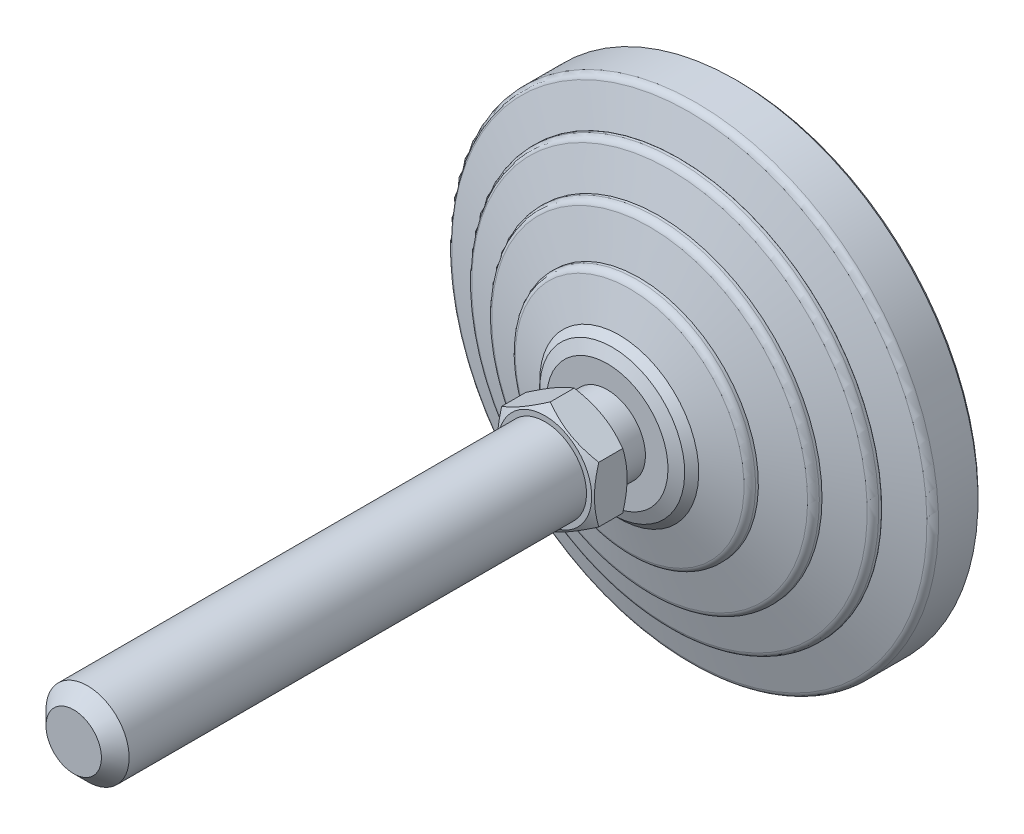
ISO-10303-21;
HEADER;
FILE_DESCRIPTION(('STEP AP214'),'2;1');
FILE_NAME('part.step','',(''),(''),'','','');
FILE_SCHEMA(('AUTOMOTIVE_DESIGN { 1 0 10303 214 1 1 1 1 }'));
ENDSEC;
DATA;
#1=APPLICATION_CONTEXT('core data for automotive mechanical design processes');
#2=APPLICATION_PROTOCOL_DEFINITION('international standard','automotive_design',2000,#1);
#3=PRODUCT_CONTEXT('',#1,'mechanical');
#4=PRODUCT('Part','Part','',(#3));
#5=PRODUCT_RELATED_PRODUCT_CATEGORY('part','',(#4));
#6=PRODUCT_DEFINITION_FORMATION('','',#4);
#7=PRODUCT_DEFINITION_CONTEXT('part definition',#1,'design');
#8=PRODUCT_DEFINITION('design','',#6,#7);
#9=PRODUCT_DEFINITION_SHAPE('','',#8);
#10=(LENGTH_UNIT() NAMED_UNIT(*) SI_UNIT(.MILLI.,.METRE.));
#11=(NAMED_UNIT(*) PLANE_ANGLE_UNIT() SI_UNIT($,.RADIAN.));
#12=(NAMED_UNIT(*) SI_UNIT($,.STERADIAN.) SOLID_ANGLE_UNIT());
#13=UNCERTAINTY_MEASURE_WITH_UNIT(LENGTH_MEASURE(1.E-05),#10,'distance_accuracy_value','');
#14=(GEOMETRIC_REPRESENTATION_CONTEXT(3) GLOBAL_UNCERTAINTY_ASSIGNED_CONTEXT((#13)) GLOBAL_UNIT_ASSIGNED_CONTEXT((#10,
#11,#12)) REPRESENTATION_CONTEXT('',''));
#15=CARTESIAN_POINT('',(0.,0.,0.));
#16=DIRECTION('',(0.,0.,1.));
#17=DIRECTION('',(1.,0.,0.));
#18=AXIS2_PLACEMENT_3D('',#15,#16,#17);
#19=CARTESIAN_POINT('',(-5.5,0.,23.));
#20=DIRECTION('',(0.,0.,1.));
#21=DIRECTION('',(0.,-1.,0.));
#22=AXIS2_PLACEMENT_3D('',#19,#20,#21);
#23=PLANE('',#22);
#24=CARTESIAN_POINT('',(0.,0.,23.));
#25=DIRECTION('',(0.,0.,-1.));
#26=DIRECTION('',(-1.,0.,0.));
#27=AXIS2_PLACEMENT_3D('',#24,#25,#26);
#28=CIRCLE('',#27,6.75);
#29=CARTESIAN_POINT('',(-6.75,0.,23.));
#30=VERTEX_POINT('',#29);
#31=EDGE_CURVE('E605',#30,#30,#28,.T.);
#32=ORIENTED_EDGE('',*,*,#31,.T.);
#33=EDGE_LOOP('',(#32));
#34=FACE_BOUND('',#33,.T.);
#35=CARTESIAN_POINT('',(0.,0.,23.));
#36=DIRECTION('',(0.,0.,-1.));
#37=DIRECTION('',(0.,1.,0.));
#38=AXIS2_PLACEMENT_3D('',#35,#36,#37);
#39=CIRCLE('',#38,5.5);
#40=CARTESIAN_POINT('',(0.,5.5,23.));
#41=VERTEX_POINT('',#40);
#42=EDGE_CURVE('E153',#41,#41,#39,.T.);
#43=ORIENTED_EDGE('',*,*,#42,.F.);
#44=EDGE_LOOP('',(#43));
#45=FACE_BOUND('',#44,.T.);
#46=ADVANCED_FACE('F14',(#34,#45),#23,.F.);
#47=CARTESIAN_POINT('',(0.,0.,0.));
#48=DIRECTION('',(0.,0.,-1.));
#49=DIRECTION('',(0.,1.,0.));
#50=AXIS2_PLACEMENT_3D('',#47,#48,#49);
#51=CYLINDRICAL_SURFACE('',#50,5.5);
#52=CARTESIAN_POINT('',(0.,0.,19.));
#53=DIRECTION('',(0.,0.,-1.));
#54=DIRECTION('',(0.,1.,0.));
#55=AXIS2_PLACEMENT_3D('',#52,#53,#54);
#56=CIRCLE('',#55,5.5);
#57=CARTESIAN_POINT('',(0.,5.5,19.));
#58=VERTEX_POINT('',#57);
#59=EDGE_CURVE('E150',#58,#58,#56,.T.);
#60=ORIENTED_EDGE('',*,*,#59,.F.);
#61=EDGE_LOOP('',(#60));
#62=FACE_BOUND('',#61,.T.);
#63=ORIENTED_EDGE('',*,*,#42,.T.);
#64=EDGE_LOOP('',(#63));
#65=FACE_BOUND('',#64,.T.);
#66=ADVANCED_FACE('F179',(#62,#65),#51,.T.);
#67=CARTESIAN_POINT('',(-8.7540983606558,0.,19.));
#68=DIRECTION('',(0.,0.,-1.));
#69=DIRECTION('',(0.,1.,0.));
#70=AXIS2_PLACEMENT_3D('',#67,#68,#69);
#71=PLANE('',#70);
#72=CARTESIAN_POINT('',(0.,0.,19.));
#73=DIRECTION('',(0.,0.,-1.));
#74=DIRECTION('',(0.,1.,0.));
#75=AXIS2_PLACEMENT_3D('',#72,#73,#74);
#76=CIRCLE('',#75,8.7540983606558);
#77=CARTESIAN_POINT('',(0.,8.7540983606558,19.));
#78=VERTEX_POINT('',#77);
#79=EDGE_CURVE('E147',#78,#78,#76,.T.);
#80=ORIENTED_EDGE('',*,*,#79,.F.);
#81=EDGE_LOOP('',(#80));
#82=FACE_BOUND('',#81,.T.);
#83=ORIENTED_EDGE('',*,*,#59,.T.);
#84=EDGE_LOOP('',(#83));
#85=FACE_BOUND('',#84,.T.);
#86=ADVANCED_FACE('F186',(#82,#85),#71,.F.);
#87=CARTESIAN_POINT('',(0.,0.,19.));
#88=DIRECTION('',(0.,0.,-1.));
#89=DIRECTION('',(0.,1.,0.));
#90=AXIS2_PLACEMENT_3D('',#87,#88,#89);
#91=CONICAL_SURFACE('',#90,8.7540983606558,1.17809724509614);
#92=CARTESIAN_POINT('',(0.,0.,18.2928932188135));
#93=DIRECTION('',(0.,0.,-1.));
#94=DIRECTION('',(0.,1.,0.));
#95=AXIS2_PLACEMENT_3D('',#92,#93,#94);
#96=CIRCLE('',#95,10.4612051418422);
#97=CARTESIAN_POINT('',(0.,10.4612051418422,18.2928932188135));
#98=VERTEX_POINT('',#97);
#99=EDGE_CURVE('E144',#98,#98,#96,.T.);
#100=ORIENTED_EDGE('',*,*,#99,.F.);
#101=EDGE_LOOP('',(#100));
#102=FACE_BOUND('',#101,.T.);
#103=ORIENTED_EDGE('',*,*,#79,.T.);
#104=EDGE_LOOP('',(#103));
#105=FACE_BOUND('',#104,.T.);
#106=ADVANCED_FACE('F433',(#102,#105),#91,.T.);
#107=CARTESIAN_POINT('',(0.,0.,18.2928932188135));
#108=DIRECTION('',(0.,0.,-1.));
#109=DIRECTION('',(0.,1.,0.));
#110=AXIS2_PLACEMENT_3D('',#107,#108,#109);
#111=CONICAL_SURFACE('',#110,10.4612051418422,0.785398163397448);
#112=CARTESIAN_POINT('',(0.,0.,17.2786885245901));
#113=DIRECTION('',(0.,0.,-1.));
#114=DIRECTION('',(0.,1.,0.));
#115=AXIS2_PLACEMENT_3D('',#112,#113,#114);
#116=CIRCLE('',#115,11.4754098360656);
#117=CARTESIAN_POINT('',(0.,11.4754098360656,17.2786885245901));
#118=VERTEX_POINT('',#117);
#119=EDGE_CURVE('E141',#118,#118,#116,.T.);
#120=ORIENTED_EDGE('',*,*,#119,.F.);
#121=EDGE_LOOP('',(#120));
#122=FACE_BOUND('',#121,.T.);
#123=ORIENTED_EDGE('',*,*,#99,.T.);
#124=EDGE_LOOP('',(#123));
#125=FACE_BOUND('',#124,.T.);
#126=ADVANCED_FACE('F423',(#122,#125),#111,.T.);
#127=CARTESIAN_POINT('',(0.,0.,17.2786885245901));
#128=DIRECTION('',(0.,0.,-1.));
#129=DIRECTION('',(0.,1.,0.));
#130=AXIS2_PLACEMENT_3D('',#127,#128,#129);
#131=CONICAL_SURFACE('',#130,11.4754098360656,1.27933953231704);
#132=CARTESIAN_POINT('',(0.,0.,15.7711726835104));
#133=DIRECTION('',(0.,0.,-1.));
#134=DIRECTION('',(0.,1.,0.));
#135=AXIS2_PLACEMENT_3D('',#132,#133,#134);
#136=CIRCLE('',#135,16.5004626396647);
#137=CARTESIAN_POINT('',(0.,16.5004626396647,15.7711726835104));
#138=VERTEX_POINT('',#137);
#139=EDGE_CURVE('E138',#138,#138,#136,.T.);
#140=ORIENTED_EDGE('',*,*,#139,.F.);
#141=EDGE_LOOP('',(#140));
#142=FACE_BOUND('',#141,.T.);
#143=ORIENTED_EDGE('',*,*,#119,.T.);
#144=EDGE_LOOP('',(#143));
#145=FACE_BOUND('',#144,.T.);
#146=ADVANCED_FACE('F413',(#142,#145),#131,.T.);
#147=CARTESIAN_POINT('',(0.,0.,14.8133463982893));
#148=DIRECTION('',(0.,0.,-1.));
#149=DIRECTION('',(0.,1.,0.));
#150=AXIS2_PLACEMENT_3D('',#147,#148,#149);
#151=TOROIDAL_SURFACE('',#150,16.2131147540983,1.);
#152=CARTESIAN_POINT('',(0.,0.,14.8133463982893));
#153=DIRECTION('',(0.,0.,-1.));
#154=DIRECTION('',(0.,1.,0.));
#155=AXIS2_PLACEMENT_3D('',#152,#153,#154);
#156=CIRCLE('',#155,17.2131147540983);
#157=CARTESIAN_POINT('',(0.,17.2131147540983,14.8133463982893));
#158=VERTEX_POINT('',#157);
#159=EDGE_CURVE('E135',#158,#158,#156,.T.);
#160=ORIENTED_EDGE('',*,*,#159,.F.);
#161=EDGE_LOOP('',(#160));
#162=FACE_BOUND('',#161,.T.);
#163=ORIENTED_EDGE('',*,*,#139,.T.);
#164=EDGE_LOOP('',(#163));
#165=FACE_BOUND('',#164,.T.);
#166=ADVANCED_FACE('F403',(#162,#165),#151,.T.);
#167=CARTESIAN_POINT('',(0.,0.,0.));
#168=DIRECTION('',(0.,0.,-1.));
#169=DIRECTION('',(0.,1.,0.));
#170=AXIS2_PLACEMENT_3D('',#167,#168,#169);
#171=CYLINDRICAL_SURFACE('',#170,17.2131147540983);
#172=CARTESIAN_POINT('',(0.,0.,14.4098360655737));
#173=DIRECTION('',(0.,0.,-1.));
#174=DIRECTION('',(0.,1.,0.));
#175=AXIS2_PLACEMENT_3D('',#172,#173,#174);
#176=CIRCLE('',#175,17.2131147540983);
#177=CARTESIAN_POINT('',(0.,17.2131147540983,14.4098360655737));
#178=VERTEX_POINT('',#177);
#179=EDGE_CURVE('E132',#178,#178,#176,.T.);
#180=ORIENTED_EDGE('',*,*,#179,.F.);
#181=EDGE_LOOP('',(#180));
#182=FACE_BOUND('',#181,.T.);
#183=ORIENTED_EDGE('',*,*,#159,.T.);
#184=EDGE_LOOP('',(#183));
#185=FACE_BOUND('',#184,.T.);
#186=ADVANCED_FACE('F393',(#182,#185),#171,.T.);
#187=CARTESIAN_POINT('',(0.,0.,14.4098360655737));
#188=DIRECTION('',(0.,0.,-1.));
#189=DIRECTION('',(0.,1.,0.));
#190=AXIS2_PLACEMENT_3D('',#187,#188,#189);
#191=CONICAL_SURFACE('',#190,17.2131147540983,1.30454427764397);
#192=CARTESIAN_POINT('',(0.,0.,12.8894925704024));
#193=DIRECTION('',(0.,0.,-1.));
#194=DIRECTION('',(0.,1.,0.));
#195=AXIS2_PLACEMENT_3D('',#192,#193,#194);
#196=CIRCLE('',#195,22.7877075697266);
#197=CARTESIAN_POINT('',(0.,22.7877075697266,12.8894925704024));
#198=VERTEX_POINT('',#197);
#199=EDGE_CURVE('E129',#198,#198,#196,.T.);
#200=ORIENTED_EDGE('',*,*,#199,.F.);
#201=EDGE_LOOP('',(#200));
#202=FACE_BOUND('',#201,.T.);
#203=ORIENTED_EDGE('',*,*,#179,.T.);
#204=EDGE_LOOP('',(#203));
#205=FACE_BOUND('',#204,.T.);
#206=ADVANCED_FACE('F383',(#202,#205),#191,.T.);
#207=CARTESIAN_POINT('',(0.,0.,11.9247287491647));
#208=DIRECTION('',(0.,0.,-1.));
#209=DIRECTION('',(0.,1.,0.));
#210=AXIS2_PLACEMENT_3D('',#207,#208,#209);
#211=TOROIDAL_SURFACE('',#210,22.5245901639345,1.);
#212=CARTESIAN_POINT('',(0.,0.,11.9247287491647));
#213=DIRECTION('',(0.,0.,-1.));
#214=DIRECTION('',(0.,1.,0.));
#215=AXIS2_PLACEMENT_3D('',#212,#213,#214);
#216=CIRCLE('',#215,23.5245901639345);
#217=CARTESIAN_POINT('',(0.,23.5245901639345,11.9247287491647));
#218=VERTEX_POINT('',#217);
#219=EDGE_CURVE('E126',#218,#218,#216,.T.);
#220=ORIENTED_EDGE('',*,*,#219,.F.);
#221=EDGE_LOOP('',(#220));
#222=FACE_BOUND('',#221,.T.);
#223=ORIENTED_EDGE('',*,*,#199,.T.);
#224=EDGE_LOOP('',(#223));
#225=FACE_BOUND('',#224,.T.);
#226=ADVANCED_FACE('F373',(#222,#225),#211,.T.);
#227=CARTESIAN_POINT('',(0.,0.,0.));
#228=DIRECTION('',(0.,0.,-1.));
#229=DIRECTION('',(0.,1.,0.));
#230=AXIS2_PLACEMENT_3D('',#227,#228,#229);
#231=CYLINDRICAL_SURFACE('',#230,23.5245901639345);
#232=CARTESIAN_POINT('',(0.,0.,11.5409836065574));
#233=DIRECTION('',(0.,0.,-1.));
#234=DIRECTION('',(0.,1.,0.));
#235=AXIS2_PLACEMENT_3D('',#232,#233,#234);
#236=CIRCLE('',#235,23.5245901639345);
#237=CARTESIAN_POINT('',(0.,23.5245901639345,11.5409836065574));
#238=VERTEX_POINT('',#237);
#239=EDGE_CURVE('E123',#238,#238,#236,.T.);
#240=ORIENTED_EDGE('',*,*,#239,.F.);
#241=EDGE_LOOP('',(#240));
#242=FACE_BOUND('',#241,.T.);
#243=ORIENTED_EDGE('',*,*,#219,.T.);
#244=EDGE_LOOP('',(#243));
#245=FACE_BOUND('',#244,.T.);
#246=ADVANCED_FACE('F363',(#242,#245),#231,.T.);
#247=CARTESIAN_POINT('',(0.,0.,11.5409836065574));
#248=DIRECTION('',(0.,0.,-1.));
#249=DIRECTION('',(0.,1.,0.));
#250=AXIS2_PLACEMENT_3D('',#247,#248,#249);
#251=CONICAL_SURFACE('',#250,23.5245901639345,1.27871257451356);
#252=CARTESIAN_POINT('',(0.,0.,10.0337743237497));
#253=DIRECTION('',(0.,0.,-1.));
#254=DIRECTION('',(0.,1.,0.));
#255=AXIS2_PLACEMENT_3D('',#252,#253,#254);
#256=CIRCLE('',#255,28.5372004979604);
#257=CARTESIAN_POINT('',(0.,28.5372004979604,10.0337743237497));
#258=VERTEX_POINT('',#257);
#259=EDGE_CURVE('E120',#258,#258,#256,.T.);
#260=ORIENTED_EDGE('',*,*,#259,.F.);
#261=EDGE_LOOP('',(#260));
#262=FACE_BOUND('',#261,.T.);
#263=ORIENTED_EDGE('',*,*,#239,.T.);
#264=EDGE_LOOP('',(#263));
#265=FACE_BOUND('',#264,.T.);
#266=ADVANCED_FACE('F353',(#262,#265),#251,.T.);
#267=CARTESIAN_POINT('',(0.,0.,9.07612838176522));
#268=DIRECTION('',(0.,0.,-1.));
#269=DIRECTION('',(0.,1.,0.));
#270=AXIS2_PLACEMENT_3D('',#267,#268,#269);
#271=TOROIDAL_SURFACE('',#270,28.2492521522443,0.999999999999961);
#272=CARTESIAN_POINT('',(0.,0.,9.07612838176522));
#273=DIRECTION('',(0.,0.,-1.));
#274=DIRECTION('',(0.,1.,0.));
#275=AXIS2_PLACEMENT_3D('',#272,#273,#274);
#276=CIRCLE('',#275,29.2492521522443);
#277=CARTESIAN_POINT('',(0.,29.2492521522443,9.07612838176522));
#278=VERTEX_POINT('',#277);
#279=EDGE_CURVE('E117',#278,#278,#276,.T.);
#280=ORIENTED_EDGE('',*,*,#279,.F.);
#281=EDGE_LOOP('',(#280));
#282=FACE_BOUND('',#281,.T.);
#283=ORIENTED_EDGE('',*,*,#259,.T.);
#284=EDGE_LOOP('',(#283));
#285=FACE_BOUND('',#284,.T.);
#286=ADVANCED_FACE('F343',(#282,#285),#271,.T.);
#287=CARTESIAN_POINT('',(0.,0.,0.));
#288=DIRECTION('',(0.,0.,-1.));
#289=DIRECTION('',(0.,1.,0.));
#290=AXIS2_PLACEMENT_3D('',#287,#288,#289);
#291=CYLINDRICAL_SURFACE('',#290,29.2492521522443);
#292=CARTESIAN_POINT('',(0.,0.,8.67213114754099));
#293=DIRECTION('',(0.,0.,-1.));
#294=DIRECTION('',(0.,1.,0.));
#295=AXIS2_PLACEMENT_3D('',#292,#293,#294);
#296=CIRCLE('',#295,29.2492521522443);
#297=CARTESIAN_POINT('',(0.,29.2492521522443,8.67213114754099));
#298=VERTEX_POINT('',#297);
#299=EDGE_CURVE('E114',#298,#298,#296,.T.);
#300=ORIENTED_EDGE('',*,*,#299,.F.);
#301=EDGE_LOOP('',(#300));
#302=FACE_BOUND('',#301,.T.);
#303=ORIENTED_EDGE('',*,*,#279,.T.);
#304=EDGE_LOOP('',(#303));
#305=FACE_BOUND('',#304,.T.);
#306=ADVANCED_FACE('F333',(#302,#305),#291,.T.);
#307=CARTESIAN_POINT('',(-29.2622950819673,0.,8.67213114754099));
#308=DIRECTION('',(0.,0.,-1.));
#309=DIRECTION('',(0.,1.,0.));
#310=AXIS2_PLACEMENT_3D('',#307,#308,#309);
#311=PLANE('',#310);
#312=CARTESIAN_POINT('',(0.,0.,8.67213114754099));
#313=DIRECTION('',(0.,0.,-1.));
#314=DIRECTION('',(0.,1.,0.));
#315=AXIS2_PLACEMENT_3D('',#312,#313,#314);
#316=CIRCLE('',#315,29.2622950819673);
#317=CARTESIAN_POINT('',(0.,29.2622950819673,8.67213114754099));
#318=VERTEX_POINT('',#317);
#319=EDGE_CURVE('E111',#318,#318,#316,.T.);
#320=ORIENTED_EDGE('',*,*,#319,.F.);
#321=EDGE_LOOP('',(#320));
#322=FACE_BOUND('',#321,.T.);
#323=ORIENTED_EDGE('',*,*,#299,.T.);
#324=EDGE_LOOP('',(#323));
#325=FACE_BOUND('',#324,.T.);
#326=ADVANCED_FACE('F323',(#322,#325),#311,.F.);
#327=CARTESIAN_POINT('',(0.,0.,8.67213114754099));
#328=DIRECTION('',(0.,0.,-1.));
#329=DIRECTION('',(0.,1.,0.));
#330=AXIS2_PLACEMENT_3D('',#327,#328,#329);
#331=CONICAL_SURFACE('',#330,29.2622950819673,1.27933953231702);
#332=CARTESIAN_POINT('',(0.,0.,7.1646153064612));
#333=DIRECTION('',(0.,0.,-1.));
#334=DIRECTION('',(0.,1.,0.));
#335=AXIS2_PLACEMENT_3D('',#332,#333,#334);
#336=CIRCLE('',#335,34.2873478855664);
#337=CARTESIAN_POINT('',(0.,34.2873478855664,7.1646153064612));
#338=VERTEX_POINT('',#337);
#339=EDGE_CURVE('E108',#338,#338,#336,.T.);
#340=ORIENTED_EDGE('',*,*,#339,.F.);
#341=EDGE_LOOP('',(#340));
#342=FACE_BOUND('',#341,.T.);
#343=ORIENTED_EDGE('',*,*,#319,.T.);
#344=EDGE_LOOP('',(#343));
#345=FACE_BOUND('',#344,.T.);
#346=ADVANCED_FACE('F313',(#342,#345),#331,.T.);
#347=CARTESIAN_POINT('',(0.,0.,6.20678902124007));
#348=DIRECTION('',(0.,0.,-1.));
#349=DIRECTION('',(0.,1.,0.));
#350=AXIS2_PLACEMENT_3D('',#347,#348,#349);
#351=TOROIDAL_SURFACE('',#350,34.,1.);
#352=CARTESIAN_POINT('',(0.,0.,6.20678902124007));
#353=DIRECTION('',(0.,0.,-1.));
#354=DIRECTION('',(0.,1.,0.));
#355=AXIS2_PLACEMENT_3D('',#352,#353,#354);
#356=CIRCLE('',#355,35.);
#357=CARTESIAN_POINT('',(0.,35.,6.20678902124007));
#358=VERTEX_POINT('',#357);
#359=EDGE_CURVE('E105',#358,#358,#356,.T.);
#360=ORIENTED_EDGE('',*,*,#359,.F.);
#361=EDGE_LOOP('',(#360));
#362=FACE_BOUND('',#361,.T.);
#363=ORIENTED_EDGE('',*,*,#339,.T.);
#364=EDGE_LOOP('',(#363));
#365=FACE_BOUND('',#364,.T.);
#366=ADVANCED_FACE('F303',(#362,#365),#351,.T.);
#367=CARTESIAN_POINT('',(0.,0.,0.));
#368=DIRECTION('',(0.,0.,-1.));
#369=DIRECTION('',(0.,1.,0.));
#370=AXIS2_PLACEMENT_3D('',#367,#368,#369);
#371=CYLINDRICAL_SURFACE('',#370,35.);
#372=CARTESIAN_POINT('',(0.,0.,0.5));
#373=DIRECTION('',(0.,0.,-1.));
#374=DIRECTION('',(0.,1.,0.));
#375=AXIS2_PLACEMENT_3D('',#372,#373,#374);
#376=CIRCLE('',#375,35.);
#377=CARTESIAN_POINT('',(0.,35.,0.5));
#378=VERTEX_POINT('',#377);
#379=EDGE_CURVE('E102',#378,#378,#376,.T.);
#380=ORIENTED_EDGE('',*,*,#379,.F.);
#381=EDGE_LOOP('',(#380));
#382=FACE_BOUND('',#381,.T.);
#383=ORIENTED_EDGE('',*,*,#359,.T.);
#384=EDGE_LOOP('',(#383));
#385=FACE_BOUND('',#384,.T.);
#386=ADVANCED_FACE('F293',(#382,#385),#371,.T.);
#387=CARTESIAN_POINT('',(0.,0.,0.5));
#388=DIRECTION('',(0.,0.,1.));
#389=DIRECTION('',(0.,-1.,0.));
#390=AXIS2_PLACEMENT_3D('',#387,#388,#389);
#391=CONICAL_SURFACE('',#390,35.,0.785398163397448);
#392=CARTESIAN_POINT('',(0.,0.,0.));
#393=DIRECTION('',(0.,0.,-1.));
#394=DIRECTION('',(0.,1.,0.));
#395=AXIS2_PLACEMENT_3D('',#392,#393,#394);
#396=CIRCLE('',#395,34.5);
#397=CARTESIAN_POINT('',(0.,34.5,0.));
#398=VERTEX_POINT('',#397);
#399=EDGE_CURVE('E99',#398,#398,#396,.T.);
#400=ORIENTED_EDGE('',*,*,#399,.F.);
#401=EDGE_LOOP('',(#400));
#402=FACE_BOUND('',#401,.T.);
#403=ORIENTED_EDGE('',*,*,#379,.T.);
#404=EDGE_LOOP('',(#403));
#405=FACE_BOUND('',#404,.T.);
#406=ADVANCED_FACE('F283',(#402,#405),#391,.T.);
#407=CARTESIAN_POINT('',(-34.5,0.,0.));
#408=DIRECTION('',(0.,0.,1.));
#409=DIRECTION('',(0.,-1.,0.));
#410=AXIS2_PLACEMENT_3D('',#407,#408,#409);
#411=PLANE('',#410);
#412=ORIENTED_EDGE('',*,*,#399,.T.);
#413=EDGE_LOOP('',(#412));
#414=FACE_BOUND('',#413,.T.);
#415=ADVANCED_FACE('F175',(#414),#411,.F.);
#416=CARTESIAN_POINT('',(0.,0.,24.9026537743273));
#417=DIRECTION('',(0.,0.,1.));
#418=DIRECTION('',(1.,0.,0.));
#419=AXIS2_PLACEMENT_3D('',#416,#417,#418);
#420=CONICAL_SURFACE('',#419,10.0454930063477,1.0471975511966);
#421=CARTESIAN_POINT('',(0.000200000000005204,-8.08301923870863,23.7696190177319));
#422=CARTESIAN_POINT('',(-0.153667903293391,-7.99418356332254,23.7183374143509));
#423=CARTESIAN_POINT('',(-0.308109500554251,-7.90501666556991,23.669383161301));
#424=CARTESIAN_POINT('',(-0.618246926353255,-7.72595873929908,23.5767703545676));
#425=CARTESIAN_POINT('',(-0.773943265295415,-7.63606741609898,23.5331140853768));
#426=CARTESIAN_POINT('',(-1.24352516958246,-7.36495417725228,23.4109491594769));
#427=CARTESIAN_POINT('',(-1.5592643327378,-7.18266208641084,23.3414631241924));
#428=CARTESIAN_POINT('',(-2.03176224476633,-6.90986528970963,23.2599825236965));
#429=CARTESIAN_POINT('',(-2.18710922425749,-6.82017566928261,23.2367710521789));
#430=CARTESIAN_POINT('',(-2.49850511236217,-6.64039116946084,23.1978487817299));
#431=CARTESIAN_POINT('',(-2.65455395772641,-6.55029632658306,23.182137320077));
#432=CARTESIAN_POINT('',(-2.96692267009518,-6.36995016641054,23.1586154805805));
#433=CARTESIAN_POINT('',(-3.12324202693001,-6.27969914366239,23.1507961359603));
#434=CARTESIAN_POINT('',(-3.43601650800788,-6.09911871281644,23.1432178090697));
#435=CARTESIAN_POINT('',(-3.59247162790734,-6.00878930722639,23.1434585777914));
#436=CARTESIAN_POINT('',(-4.02110687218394,-5.76131663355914,23.155197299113));
#437=CARTESIAN_POINT('',(-4.2931466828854,-5.60425437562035,23.1749033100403));
#438=CARTESIAN_POINT('',(-4.8354194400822,-5.29117305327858,23.2373910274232));
#439=CARTESIAN_POINT('',(-5.10565047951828,-5.13515508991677,23.2801940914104));
#440=CARTESIAN_POINT('',(-5.64901454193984,-4.82144370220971,23.3871892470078));
#441=CARTESIAN_POINT('',(-5.92207900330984,-4.66378986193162,23.4518346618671));
#442=CARTESIAN_POINT('',(-6.46413578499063,-4.35083323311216,23.5985536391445));
#443=CARTESIAN_POINT('',(-6.73313504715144,-4.1955264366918,23.680592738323));
#444=CARTESIAN_POINT('',(-7.0002,-4.04133641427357,23.7696190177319));
#445=B_SPLINE_CURVE_WITH_KNOTS('',3,(#421,#422,#423,#424,#425,#426,#427,#428,#429,#430,#431,
#432,#433,#434,#435,#436,#437,#438,#439,#440,#441,#442,#443,#444),.UNSPECIFIED.,.F.,.F.,(4,2,2,
2,2,2,2,2,2,2,2,4),(0.,0.554727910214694,1.10969417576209,2.2219327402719,2.76443041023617,
3.30688013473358,3.8487128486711,4.39052882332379,5.33376515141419,6.27787517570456,
7.2429241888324,8.20607866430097),.UNSPECIFIED.);
#446=CARTESIAN_POINT('',(0.,-8.08290376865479,23.7695523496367));
#447=VERTEX_POINT('',#446);
#448=CARTESIAN_POINT('',(-7.,-4.04145188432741,23.7695523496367));
#449=VERTEX_POINT('',#448);
#450=EDGE_CURVE('E73',#447,#449,#445,.T.);
#451=ORIENTED_EDGE('',*,*,#450,.T.);
#452=CARTESIAN_POINT('',(-7.,-10.8562782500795,26.5607400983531));
#453=CARTESIAN_POINT('',(-7.,-10.5505377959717,26.4124267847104));
#454=CARTESIAN_POINT('',(-7.,-10.2440955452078,26.2655354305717));
#455=CARTESIAN_POINT('',(-7.,-9.62943422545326,25.9753963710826));
#456=CARTESIAN_POINT('',(-7.,-9.32121488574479,25.8321492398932));
#457=CARTESIAN_POINT('',(-7.,-8.70103836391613,25.5493777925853));
#458=CARTESIAN_POINT('',(-7.,-8.3890699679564,25.4098779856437));
#459=CARTESIAN_POINT('',(-7.,-7.76265209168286,25.1365865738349));
#460=CARTESIAN_POINT('',(-7.,-7.44820272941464,25.0027946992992));
#461=CARTESIAN_POINT('',(-7.,-6.80617226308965,24.7382436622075));
#462=CARTESIAN_POINT('',(-7.,-6.4784936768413,24.6077197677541));
#463=CARTESIAN_POINT('',(-7.,-5.81930384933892,24.3565493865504));
#464=CARTESIAN_POINT('',(-7.,-5.48779218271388,24.2359040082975));
#465=CARTESIAN_POINT('',(-7.,-4.82102509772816,24.0076578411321));
#466=CARTESIAN_POINT('',(-7.,-4.48577881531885,23.9000306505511));
#467=CARTESIAN_POINT('',(-7.,-3.81048933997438,23.7012727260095));
#468=CARTESIAN_POINT('',(-7.,-3.47044769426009,23.6101367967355));
#469=CARTESIAN_POINT('',(-7.,-2.78720486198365,23.4492253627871));
#470=CARTESIAN_POINT('',(-7.,-2.44403170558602,23.3793340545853));
#471=CARTESIAN_POINT('',(-7.,-1.92614654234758,23.2934561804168));
#472=CARTESIAN_POINT('',(-7.,-1.75298454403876,23.2679889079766));
#473=CARTESIAN_POINT('',(-7.,-1.40579968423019,23.2238735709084));
#474=CARTESIAN_POINT('',(-7.,-1.2317769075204,23.2052248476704));
#475=CARTESIAN_POINT('',(-7.,-0.885377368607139,23.1753520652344));
#476=CARTESIAN_POINT('',(-7.,-0.713008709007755,23.1640344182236));
#477=CARTESIAN_POINT('',(-7.,-0.367947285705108,23.1486982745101));
#478=CARTESIAN_POINT('',(-7.,-0.195254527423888,23.1446796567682));
#479=CARTESIAN_POINT('',(-7.,0.15014644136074,23.1440374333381));
#480=CARTESIAN_POINT('',(-7.,0.322854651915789,23.1474138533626));
#481=CARTESIAN_POINT('',(-7.,0.667975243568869,23.1614792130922));
#482=CARTESIAN_POINT('',(-7.,0.840387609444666,23.1721685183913));
#483=CARTESIAN_POINT('',(-7.,1.25472987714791,23.2064183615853));
#484=CARTESIAN_POINT('',(-7.,1.49637909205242,23.2334476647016));
#485=CARTESIAN_POINT('',(-7.,1.97787297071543,23.3003972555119));
#486=CARTESIAN_POINT('',(-7.,2.21771738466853,23.3403192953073));
#487=CARTESIAN_POINT('',(-7.,2.93427526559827,23.4773067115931));
#488=CARTESIAN_POINT('',(-7.,3.40774415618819,23.5915681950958));
#489=CARTESIAN_POINT('',(-7.,4.11571055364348,23.7895741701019));
#490=CARTESIAN_POINT('',(-7.,4.35388352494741,23.8609317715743));
#491=CARTESIAN_POINT('',(-7.,4.82791592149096,24.01102534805));
#492=CARTESIAN_POINT('',(-7.,5.06377533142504,24.0897613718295));
#493=CARTESIAN_POINT('',(-7.,5.53325546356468,24.2533512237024));
#494=CARTESIAN_POINT('',(-7.,5.76687690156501,24.3382030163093));
#495=CARTESIAN_POINT('',(-7.,6.23218631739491,24.513029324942));
#496=CARTESIAN_POINT('',(-7.,6.46387431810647,24.6030037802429));
#497=CARTESIAN_POINT('',(-7.,7.01161592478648,24.8215750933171));
#498=CARTESIAN_POINT('',(-7.,7.32691342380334,24.95206328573));
#499=CARTESIAN_POINT('',(-7.,7.95482044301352,25.2193727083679));
#500=CARTESIAN_POINT('',(-7.,8.26742979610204,25.3561943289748));
#501=CARTESIAN_POINT('',(-7.,8.89045666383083,25.6348950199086));
#502=CARTESIAN_POINT('',(-7.,9.20087371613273,25.7767751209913));
#503=CARTESIAN_POINT('',(-7.,9.81983167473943,26.0645775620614));
#504=CARTESIAN_POINT('',(-7.,10.1283725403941,26.2104999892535));
#505=CARTESIAN_POINT('',(-7.,10.7442118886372,26.5057822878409));
#506=CARTESIAN_POINT('',(-7.,11.05150867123,26.655145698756));
#507=CARTESIAN_POINT('',(-7.,11.6647763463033,26.956572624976));
#508=CARTESIAN_POINT('',(-7.,11.9707472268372,27.1086361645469));
#509=CARTESIAN_POINT('',(-7.,12.8869063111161,27.5681158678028));
#510=CARTESIAN_POINT('',(-7.,13.4954244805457,27.878861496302));
#511=CARTESIAN_POINT('',(-7.,14.6580907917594,28.4801449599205));
#512=CARTESIAN_POINT('',(-7.,15.212500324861,28.7701796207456));
#513=CARTESIAN_POINT('',(-7.,16.3192620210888,29.3541930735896));
#514=CARTESIAN_POINT('',(-7.,16.8716141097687,29.6481720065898));
#515=CARTESIAN_POINT('',(-7.,17.9733289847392,30.2383900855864));
#516=CARTESIAN_POINT('',(-7.,18.5226957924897,30.5346217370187));
#517=CARTESIAN_POINT('',(-7.,19.6201147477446,31.1294388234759));
#518=CARTESIAN_POINT('',(-7.,20.1681669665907,31.4280241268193));
#519=CARTESIAN_POINT('',(-7.,20.7157357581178,31.7274874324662));
#520=B_SPLINE_CURVE_WITH_KNOTS('',3,(#452,#453,#454,#455,#456,#457,#458,#459,#460,#461,#462,
#463,#464,#465,#466,#467,#468,#469,#470,#471,#472,#473,#474,#475,#476,#477,#478,#479,#480,#481,
#482,#483,#484,#485,#486,#487,#488,#489,#490,#491,#492,#493,#494,#495,#496,#497,#498,#499,#500,
#501,#502,#503,#504,#505,#506,#507,#508,#509,#510,#511,#512,#513,#514,#515,#516,#517,#518,#519),
.UNSPECIFIED.,.F.,.F.,(4,2,2,2,2,2,2,2,2,2,2,2,2,2,2,2,2,2,2,2,2,2,2,2,2,2,2,2,2,2,2,2,2,4),(0.,
1.01945669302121,2.03907302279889,3.06423951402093,4.08935751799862,5.14738688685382,
6.20553481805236,7.2614994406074,8.31713081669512,9.36690030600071,9.89186140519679,
10.416771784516,10.9348417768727,11.4529031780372,11.9709663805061,12.489055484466,
13.2181120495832,13.9472677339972,15.4063866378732,16.1522231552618,16.8980646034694,
17.6436589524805,18.3892444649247,19.4128487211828,20.4365161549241,21.4603933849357,
22.4842927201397,23.5092969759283,24.5343104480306,26.584059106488,28.4611171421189,
30.3382424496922,32.2106715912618,34.0829967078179),.UNSPECIFIED.);
#521=CARTESIAN_POINT('',(-7.,4.04145188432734,23.7695523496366));
#522=VERTEX_POINT('',#521);
#523=EDGE_CURVE('E81',#449,#522,#520,.T.);
#524=ORIENTED_EDGE('',*,*,#523,.T.);
#525=CARTESIAN_POINT('',(-7.0002,4.0413364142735,23.7696190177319));
#526=CARTESIAN_POINT('',(-6.84633209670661,4.13017208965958,23.7183374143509));
#527=CARTESIAN_POINT('',(-6.69189049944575,4.21933898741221,23.669383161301));
#528=CARTESIAN_POINT('',(-6.38175307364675,4.39839691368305,23.5767703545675));
#529=CARTESIAN_POINT('',(-6.22605673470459,4.48828823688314,23.5331140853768));
#530=CARTESIAN_POINT('',(-5.75647483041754,4.75940147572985,23.4109491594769));
#531=CARTESIAN_POINT('',(-5.44073566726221,4.94169356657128,23.3414631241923));
#532=CARTESIAN_POINT('',(-4.96823775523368,5.21449036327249,23.2599825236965));
#533=CARTESIAN_POINT('',(-4.81289077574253,5.3041799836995,23.2367710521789));
#534=CARTESIAN_POINT('',(-4.50149488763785,5.48396448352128,23.1978487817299));
#535=CARTESIAN_POINT('',(-4.34544604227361,5.57405932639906,23.1821373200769));
#536=CARTESIAN_POINT('',(-4.03307732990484,5.75440548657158,23.1586154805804));
#537=CARTESIAN_POINT('',(-3.87675797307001,5.84465650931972,23.1507961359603));
#538=CARTESIAN_POINT('',(-3.56398349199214,6.02523694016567,23.1432178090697));
#539=CARTESIAN_POINT('',(-3.40752837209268,6.11556634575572,23.1434585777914));
#540=CARTESIAN_POINT('',(-2.97889312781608,6.36303901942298,23.155197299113));
#541=CARTESIAN_POINT('',(-2.70685331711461,6.52010127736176,23.1749033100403));
#542=CARTESIAN_POINT('',(-2.16458055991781,6.83318259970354,23.2373910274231));
#543=CARTESIAN_POINT('',(-1.89434952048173,6.98920056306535,23.2801940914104));
#544=CARTESIAN_POINT('',(-1.35098545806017,7.30291195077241,23.3871892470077));
#545=CARTESIAN_POINT('',(-1.07792099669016,7.4605657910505,23.451834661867));
#546=CARTESIAN_POINT('',(-0.53586421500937,7.77352241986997,23.5985536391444));
#547=CARTESIAN_POINT('',(-0.266864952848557,7.92882921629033,23.6805927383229));
#548=CARTESIAN_POINT('',(0.000200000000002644,8.08301923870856,23.7696190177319));
#549=B_SPLINE_CURVE_WITH_KNOTS('',3,(#525,#526,#527,#528,#529,#530,#531,#532,#533,#534,#535,
#536,#537,#538,#539,#540,#541,#542,#543,#544,#545,#546,#547,#548),.UNSPECIFIED.,.F.,.F.,(4,2,2,
2,2,2,2,2,2,2,2,4),(0.,0.554727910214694,1.10969417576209,2.22193274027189,2.76443041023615,
3.30688013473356,3.84871284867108,4.39052882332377,5.33376515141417,6.27787517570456,
7.2429241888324,8.20607866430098),.UNSPECIFIED.);
#550=CARTESIAN_POINT('',(0.,8.08290376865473,23.7695523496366));
#551=VERTEX_POINT('',#550);
#552=EDGE_CURVE('E560',#522,#551,#549,.T.);
#553=ORIENTED_EDGE('',*,*,#552,.T.);
#554=CARTESIAN_POINT('',(-0.000199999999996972,8.08301923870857,23.7696190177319));
#555=CARTESIAN_POINT('',(0.153667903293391,7.99418356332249,23.7183374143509));
#556=CARTESIAN_POINT('',(0.308109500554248,7.90501666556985,23.669383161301));
#557=CARTESIAN_POINT('',(0.61824692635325,7.72595873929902,23.5767703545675));
#558=CARTESIAN_POINT('',(0.773943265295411,7.63606741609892,23.5331140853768));
#559=CARTESIAN_POINT('',(1.24352516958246,7.36495417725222,23.4109491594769));
#560=CARTESIAN_POINT('',(1.55926433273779,7.18266208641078,23.3414631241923));
#561=CARTESIAN_POINT('',(2.03176224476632,6.90986528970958,23.2599825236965));
#562=CARTESIAN_POINT('',(2.18710922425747,6.82017566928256,23.2367710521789));
#563=CARTESIAN_POINT('',(2.49850511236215,6.64039116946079,23.1978487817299));
#564=CARTESIAN_POINT('',(2.65455395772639,6.55029632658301,23.1821373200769));
#565=CARTESIAN_POINT('',(2.96692267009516,6.36995016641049,23.1586154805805));
#566=CARTESIAN_POINT('',(3.12324202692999,6.27969914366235,23.1507961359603));
#567=CARTESIAN_POINT('',(3.43601650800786,6.0991187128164,23.1432178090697));
#568=CARTESIAN_POINT('',(3.59247162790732,6.00878930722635,23.1434585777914));
#569=CARTESIAN_POINT('',(4.02110687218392,5.7613166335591,23.155197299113));
#570=CARTESIAN_POINT('',(4.29314668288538,5.60425437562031,23.1749033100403));
#571=CARTESIAN_POINT('',(4.83541944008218,5.29117305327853,23.2373910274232));
#572=CARTESIAN_POINT('',(5.10565047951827,5.13515508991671,23.2801940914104));
#573=CARTESIAN_POINT('',(5.64901454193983,4.82144370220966,23.3871892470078));
#574=CARTESIAN_POINT('',(5.92207900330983,4.66378986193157,23.4518346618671));
#575=CARTESIAN_POINT('',(6.46413578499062,4.3508332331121,23.5985536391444));
#576=CARTESIAN_POINT('',(6.73313504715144,4.19552643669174,23.680592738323));
#577=CARTESIAN_POINT('',(7.0002,4.04133641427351,23.7696190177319));
#578=B_SPLINE_CURVE_WITH_KNOTS('',3,(#554,#555,#556,#557,#558,#559,#560,#561,#562,#563,#564,
#565,#566,#567,#568,#569,#570,#571,#572,#573,#574,#575,#576,#577),.UNSPECIFIED.,.F.,.F.,(4,2,2,
2,2,2,2,2,2,2,2,4),(0.,0.554727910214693,1.10969417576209,2.22193274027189,2.76443041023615,
3.30688013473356,3.84871284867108,4.39052882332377,5.33376515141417,6.27787517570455,
7.24292418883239,8.20607866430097),.UNSPECIFIED.);
#579=CARTESIAN_POINT('',(7.,4.04145188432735,23.7695523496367));
#580=VERTEX_POINT('',#579);
#581=EDGE_CURVE('E555',#551,#580,#578,.T.);
#582=ORIENTED_EDGE('',*,*,#581,.T.);
#583=CARTESIAN_POINT('',(7.,-10.8562782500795,26.5607400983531));
#584=CARTESIAN_POINT('',(7.,-10.5505377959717,26.4124267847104));
#585=CARTESIAN_POINT('',(7.,-10.2440955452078,26.2655354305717));
#586=CARTESIAN_POINT('',(7.,-9.62943422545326,25.9753963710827));
#587=CARTESIAN_POINT('',(7.,-9.32121488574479,25.8321492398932));
#588=CARTESIAN_POINT('',(7.,-8.70103836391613,25.5493777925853));
#589=CARTESIAN_POINT('',(7.,-8.3890699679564,25.4098779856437));
#590=CARTESIAN_POINT('',(7.,-7.76265209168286,25.1365865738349));
#591=CARTESIAN_POINT('',(7.,-7.44820272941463,25.0027946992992));
#592=CARTESIAN_POINT('',(7.,-6.80617226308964,24.7382436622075));
#593=CARTESIAN_POINT('',(7.,-6.4784936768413,24.6077197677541));
#594=CARTESIAN_POINT('',(7.,-5.81930384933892,24.3565493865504));
#595=CARTESIAN_POINT('',(7.,-5.48779218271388,24.2359040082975));
#596=CARTESIAN_POINT('',(7.,-4.82102509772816,24.0076578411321));
#597=CARTESIAN_POINT('',(7.,-4.48577881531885,23.9000306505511));
#598=CARTESIAN_POINT('',(7.,-3.81048933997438,23.7012727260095));
#599=CARTESIAN_POINT('',(7.,-3.47044769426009,23.6101367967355));
#600=CARTESIAN_POINT('',(7.,-2.78720486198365,23.4492253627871));
#601=CARTESIAN_POINT('',(7.,-2.44403170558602,23.3793340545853));
#602=CARTESIAN_POINT('',(7.,-1.92614654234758,23.2934561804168));
#603=CARTESIAN_POINT('',(7.,-1.75298454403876,23.2679889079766));
#604=CARTESIAN_POINT('',(7.,-1.40579968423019,23.2238735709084));
#605=CARTESIAN_POINT('',(7.,-1.2317769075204,23.2052248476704));
#606=CARTESIAN_POINT('',(7.,-0.88537736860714,23.1753520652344));
#607=CARTESIAN_POINT('',(7.,-0.713008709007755,23.1640344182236));
#608=CARTESIAN_POINT('',(7.,-0.367947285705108,23.1486982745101));
#609=CARTESIAN_POINT('',(7.,-0.195254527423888,23.1446796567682));
#610=CARTESIAN_POINT('',(7.,0.150146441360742,23.1440374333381));
#611=CARTESIAN_POINT('',(7.,0.322854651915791,23.1474138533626));
#612=CARTESIAN_POINT('',(7.,0.667975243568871,23.1614792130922));
#613=CARTESIAN_POINT('',(7.,0.840387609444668,23.1721685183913));
#614=CARTESIAN_POINT('',(7.,1.25472987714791,23.2064183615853));
#615=CARTESIAN_POINT('',(7.,1.49637909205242,23.2334476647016));
#616=CARTESIAN_POINT('',(7.,1.97787297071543,23.3003972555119));
#617=CARTESIAN_POINT('',(7.,2.21771738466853,23.3403192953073));
#618=CARTESIAN_POINT('',(7.,2.93427526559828,23.4773067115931));
#619=CARTESIAN_POINT('',(7.,3.40774415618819,23.5915681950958));
#620=CARTESIAN_POINT('',(7.,4.11571055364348,23.7895741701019));
#621=CARTESIAN_POINT('',(7.,4.35388352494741,23.8609317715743));
#622=CARTESIAN_POINT('',(7.,4.82791592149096,24.01102534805));
#623=CARTESIAN_POINT('',(7.,5.06377533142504,24.0897613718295));
#624=CARTESIAN_POINT('',(7.,5.53325546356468,24.2533512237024));
#625=CARTESIAN_POINT('',(7.,5.76687690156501,24.3382030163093));
#626=CARTESIAN_POINT('',(7.,6.23218631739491,24.513029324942));
#627=CARTESIAN_POINT('',(7.,6.46387431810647,24.6030037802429));
#628=CARTESIAN_POINT('',(7.,7.01161592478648,24.8215750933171));
#629=CARTESIAN_POINT('',(7.,7.32691342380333,24.95206328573));
#630=CARTESIAN_POINT('',(7.,7.95482044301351,25.2193727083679));
#631=CARTESIAN_POINT('',(7.,8.26742979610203,25.3561943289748));
#632=CARTESIAN_POINT('',(7.,8.89045666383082,25.6348950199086));
#633=CARTESIAN_POINT('',(7.,9.20087371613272,25.7767751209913));
#634=CARTESIAN_POINT('',(7.,9.81983167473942,26.0645775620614));
#635=CARTESIAN_POINT('',(7.,10.1283725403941,26.2104999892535));
#636=CARTESIAN_POINT('',(7.,10.7442118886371,26.5057822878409));
#637=CARTESIAN_POINT('',(7.,11.0515086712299,26.655145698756));
#638=CARTESIAN_POINT('',(7.,11.6647763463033,26.956572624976));
#639=CARTESIAN_POINT('',(7.,11.9707472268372,27.1086361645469));
#640=CARTESIAN_POINT('',(7.,12.8869063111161,27.5681158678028));
#641=CARTESIAN_POINT('',(7.,13.4954244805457,27.878861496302));
#642=CARTESIAN_POINT('',(7.,14.6580907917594,28.4801449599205));
#643=CARTESIAN_POINT('',(7.,15.212500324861,28.7701796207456));
#644=CARTESIAN_POINT('',(7.,16.3192620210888,29.3541930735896));
#645=CARTESIAN_POINT('',(7.,16.8716141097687,29.6481720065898));
#646=CARTESIAN_POINT('',(7.,17.9733289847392,30.2383900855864));
#647=CARTESIAN_POINT('',(7.,18.5226957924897,30.5346217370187));
#648=CARTESIAN_POINT('',(7.,19.6201147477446,31.1294388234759));
#649=CARTESIAN_POINT('',(7.,20.1681669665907,31.4280241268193));
#650=CARTESIAN_POINT('',(7.,20.7157357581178,31.7274874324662));
#651=B_SPLINE_CURVE_WITH_KNOTS('',3,(#583,#584,#585,#586,#587,#588,#589,#590,#591,#592,#593,
#594,#595,#596,#597,#598,#599,#600,#601,#602,#603,#604,#605,#606,#607,#608,#609,#610,#611,#612,
#613,#614,#615,#616,#617,#618,#619,#620,#621,#622,#623,#624,#625,#626,#627,#628,#629,#630,#631,
#632,#633,#634,#635,#636,#637,#638,#639,#640,#641,#642,#643,#644,#645,#646,#647,#648,#649,#650),
.UNSPECIFIED.,.F.,.F.,(4,2,2,2,2,2,2,2,2,2,2,2,2,2,2,2,2,2,2,2,2,2,2,2,2,2,2,2,2,2,2,2,2,4),(0.,
1.01945669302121,2.03907302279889,3.06423951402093,4.08935751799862,5.14738688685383,
6.20553481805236,7.2614994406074,8.31713081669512,9.36690030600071,9.89186140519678,
10.416771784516,10.9348417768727,11.4529031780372,11.9709663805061,12.489055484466,
13.2181120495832,13.9472677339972,15.4063866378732,16.1522231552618,16.8980646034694,
17.6436589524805,18.3892444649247,19.4128487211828,20.4365161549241,21.4603933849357,
22.4842927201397,23.5092969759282,24.5343104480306,26.584059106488,28.4611171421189,
30.3382424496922,32.2106715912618,34.0829967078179),.UNSPECIFIED.);
#652=CARTESIAN_POINT('',(7.,-4.04145188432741,23.7695523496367));
#653=VERTEX_POINT('',#652);
#654=EDGE_CURVE('E34',#580,#653,#651,.F.);
#655=ORIENTED_EDGE('',*,*,#654,.T.);
#656=CARTESIAN_POINT('',(7.0002,-4.04133641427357,23.7696190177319));
#657=CARTESIAN_POINT('',(6.84633209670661,-4.13017208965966,23.7183374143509));
#658=CARTESIAN_POINT('',(6.69189049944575,-4.21933898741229,23.669383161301));
#659=CARTESIAN_POINT('',(6.38175307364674,-4.39839691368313,23.5767703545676));
#660=CARTESIAN_POINT('',(6.22605673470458,-4.48828823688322,23.5331140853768));
#661=CARTESIAN_POINT('',(5.75647483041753,-4.75940147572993,23.4109491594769));
#662=CARTESIAN_POINT('',(5.44073566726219,-4.94169356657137,23.3414631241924));
#663=CARTESIAN_POINT('',(4.96823775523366,-5.21449036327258,23.2599825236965));
#664=CARTESIAN_POINT('',(4.81289077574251,-5.30417998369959,23.2367710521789));
#665=CARTESIAN_POINT('',(4.50149488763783,-5.48396448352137,23.1978487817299));
#666=CARTESIAN_POINT('',(4.34544604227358,-5.57405932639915,23.182137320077));
#667=CARTESIAN_POINT('',(4.03307732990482,-5.75440548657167,23.1586154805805));
#668=CARTESIAN_POINT('',(3.87675797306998,-5.84465650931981,23.1507961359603));
#669=CARTESIAN_POINT('',(3.56398349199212,-6.02523694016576,23.1432178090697));
#670=CARTESIAN_POINT('',(3.40752837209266,-6.11556634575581,23.1434585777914));
#671=CARTESIAN_POINT('',(2.97889312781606,-6.36303901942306,23.155197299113));
#672=CARTESIAN_POINT('',(2.7068533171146,-6.52010127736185,23.1749033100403));
#673=CARTESIAN_POINT('',(2.1645805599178,-6.83318259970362,23.2373910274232));
#674=CARTESIAN_POINT('',(1.89434952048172,-6.98920056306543,23.2801940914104));
#675=CARTESIAN_POINT('',(1.35098545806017,-7.30291195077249,23.3871892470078));
#676=CARTESIAN_POINT('',(1.07792099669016,-7.46056579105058,23.4518346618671));
#677=CARTESIAN_POINT('',(0.535864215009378,-7.77352241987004,23.5985536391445));
#678=CARTESIAN_POINT('',(0.266864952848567,-7.9288292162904,23.680592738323));
#679=CARTESIAN_POINT('',(-0.000199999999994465,-8.08301923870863,23.7696190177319));
#680=B_SPLINE_CURVE_WITH_KNOTS('',3,(#656,#657,#658,#659,#660,#661,#662,#663,#664,#665,#666,
#667,#668,#669,#670,#671,#672,#673,#674,#675,#676,#677,#678,#679),.UNSPECIFIED.,.F.,.F.,(4,2,2,
2,2,2,2,2,2,2,2,4),(0.,0.554727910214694,1.10969417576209,2.2219327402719,2.76443041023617,
3.30688013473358,3.8487128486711,4.39052882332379,5.33376515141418,6.27787517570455,
7.24292418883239,8.20607866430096),.UNSPECIFIED.);
#681=EDGE_CURVE('E9',#653,#447,#680,.T.);
#682=ORIENTED_EDGE('',*,*,#681,.T.);
#683=EDGE_LOOP('',(#451,#524,#553,#582,#655,#682));
#684=FACE_BOUND('',#683,.T.);
#685=ORIENTED_EDGE('',*,*,#31,.F.);
#686=EDGE_LOOP('',(#685));
#687=FACE_BOUND('',#686,.T.);
#688=ADVANCED_FACE('F71',(#684,#687),#420,.T.);
#689=CARTESIAN_POINT('',(-3.99999999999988,0.,96.));
#690=DIRECTION('',(0.,0.,-1.));
#691=DIRECTION('',(0.,1.,0.));
#692=AXIS2_PLACEMENT_3D('',#689,#690,#691);
#693=PLANE('',#692);
#694=CARTESIAN_POINT('',(0.,0.,96.));
#695=DIRECTION('',(0.,0.,-1.));
#696=DIRECTION('',(0.,1.,0.));
#697=AXIS2_PLACEMENT_3D('',#694,#695,#696);
#698=CIRCLE('',#697,3.99999999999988);
#699=CARTESIAN_POINT('',(0.,3.99999999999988,96.));
#700=VERTEX_POINT('',#699);
#701=EDGE_CURVE('E96',#700,#700,#698,.T.);
#702=ORIENTED_EDGE('',*,*,#701,.F.);
#703=EDGE_LOOP('',(#702));
#704=FACE_BOUND('',#703,.T.);
#705=ADVANCED_FACE('F165',(#704),#693,.F.);
#706=CARTESIAN_POINT('',(0.,0.,96.));
#707=DIRECTION('',(0.,0.,-1.));
#708=DIRECTION('',(0.,1.,0.));
#709=AXIS2_PLACEMENT_3D('',#706,#707,#708);
#710=CONICAL_SURFACE('',#709,3.99999999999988,0.785398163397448);
#711=CARTESIAN_POINT('',(0.,0.,94.));
#712=DIRECTION('',(0.,0.,-1.));
#713=DIRECTION('',(0.,1.,0.));
#714=AXIS2_PLACEMENT_3D('',#711,#712,#713);
#715=CIRCLE('',#714,5.99999999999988);
#716=CARTESIAN_POINT('',(0.,5.99999999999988,94.));
#717=VERTEX_POINT('',#716);
#718=EDGE_CURVE('E28',#717,#717,#715,.T.);
#719=ORIENTED_EDGE('',*,*,#718,.F.);
#720=EDGE_LOOP('',(#719));
#721=FACE_BOUND('',#720,.T.);
#722=ORIENTED_EDGE('',*,*,#701,.T.);
#723=EDGE_LOOP('',(#722));
#724=FACE_BOUND('',#723,.T.);
#725=ADVANCED_FACE('F16',(#721,#724),#710,.T.);
#726=CARTESIAN_POINT('',(0.,0.,0.));
#727=DIRECTION('',(0.,0.,-1.));
#728=DIRECTION('',(0.,1.,0.));
#729=AXIS2_PLACEMENT_3D('',#726,#727,#728);
#730=CYLINDRICAL_SURFACE('',#729,5.99999999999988);
#731=CARTESIAN_POINT('',(0.,0.,28.));
#732=DIRECTION('',(0.,0.,-1.));
#733=DIRECTION('',(0.,1.,0.));
#734=AXIS2_PLACEMENT_3D('',#731,#732,#733);
#735=CIRCLE('',#734,5.99999999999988);
#736=CARTESIAN_POINT('',(0.,5.99999999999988,28.));
#737=VERTEX_POINT('',#736);
#738=EDGE_CURVE('E156',#737,#737,#735,.T.);
#739=ORIENTED_EDGE('',*,*,#738,.F.);
#740=EDGE_LOOP('',(#739));
#741=FACE_BOUND('',#740,.T.);
#742=ORIENTED_EDGE('',*,*,#718,.T.);
#743=EDGE_LOOP('',(#742));
#744=FACE_BOUND('',#743,.T.);
#745=ADVANCED_FACE('F161',(#741,#744),#730,.T.);
#746=CARTESIAN_POINT('',(-5.99999999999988,0.,28.));
#747=DIRECTION('',(0.,0.,-1.));
#748=DIRECTION('',(0.,1.,0.));
#749=AXIS2_PLACEMENT_3D('',#746,#747,#748);
#750=PLANE('',#749);
#751=CARTESIAN_POINT('',(0.,0.,28.));
#752=DIRECTION('',(0.,0.,-1.));
#753=DIRECTION('',(-1.,0.,0.));
#754=AXIS2_PLACEMENT_3D('',#751,#752,#753);
#755=CIRCLE('',#754,6.75);
#756=CARTESIAN_POINT('',(-6.75,0.,28.));
#757=VERTEX_POINT('',#756);
#758=EDGE_CURVE('E80',#757,#757,#755,.T.);
#759=ORIENTED_EDGE('',*,*,#758,.F.);
#760=EDGE_LOOP('',(#759));
#761=FACE_BOUND('',#760,.T.);
#762=ORIENTED_EDGE('',*,*,#738,.T.);
#763=EDGE_LOOP('',(#762));
#764=FACE_BOUND('',#763,.T.);
#765=ADVANCED_FACE('F193',(#761,#764),#750,.F.);
#766=CARTESIAN_POINT('',(0.,0.,28.));
#767=DIRECTION('',(0.,0.,-1.));
#768=DIRECTION('',(-1.,0.,0.));
#769=AXIS2_PLACEMENT_3D('',#766,#767,#768);
#770=CONICAL_SURFACE('',#769,6.75,1.0471975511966);
#771=CARTESIAN_POINT('',(-7.0002,-4.04133641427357,27.2303809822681));
#772=CARTESIAN_POINT('',(-6.84633209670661,-4.13017208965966,27.2816625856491));
#773=CARTESIAN_POINT('',(-6.69189049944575,-4.21933898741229,27.330616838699));
#774=CARTESIAN_POINT('',(-6.38175307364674,-4.39839691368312,27.4232296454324));
#775=CARTESIAN_POINT('',(-6.22605673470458,-4.48828823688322,27.4668859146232));
#776=CARTESIAN_POINT('',(-5.75647483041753,-4.75940147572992,27.5890508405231));
#777=CARTESIAN_POINT('',(-5.4407356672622,-4.94169356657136,27.6585368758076));
#778=CARTESIAN_POINT('',(-4.96823775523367,-5.21449036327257,27.7400174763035));
#779=CARTESIAN_POINT('',(-4.81289077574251,-5.30417998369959,27.7632289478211));
#780=CARTESIAN_POINT('',(-4.50149488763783,-5.48396448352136,27.8021512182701));
#781=CARTESIAN_POINT('',(-4.34544604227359,-5.57405932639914,27.8178626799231));
#782=CARTESIAN_POINT('',(-4.03307732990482,-5.75440548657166,27.8413845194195));
#783=CARTESIAN_POINT('',(-3.87675797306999,-5.8446565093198,27.8492038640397));
#784=CARTESIAN_POINT('',(-3.56398349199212,-6.02523694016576,27.8567821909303));
#785=CARTESIAN_POINT('',(-3.40752837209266,-6.11556634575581,27.8565414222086));
#786=CARTESIAN_POINT('',(-2.97889312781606,-6.36303901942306,27.844802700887));
#787=CARTESIAN_POINT('',(-2.7068533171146,-6.52010127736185,27.8250966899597));
#788=CARTESIAN_POINT('',(-2.1645805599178,-6.83318259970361,27.7626089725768));
#789=CARTESIAN_POINT('',(-1.89434952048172,-6.98920056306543,27.7198059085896));
#790=CARTESIAN_POINT('',(-1.35098545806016,-7.30291195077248,27.6128107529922));
#791=CARTESIAN_POINT('',(-1.07792099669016,-7.46056579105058,27.5481653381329));
#792=CARTESIAN_POINT('',(-0.53586421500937,-7.77352241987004,27.4014463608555));
#793=CARTESIAN_POINT('',(-0.266864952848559,-7.9288292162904,27.319407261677));
#794=CARTESIAN_POINT('',(0.000200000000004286,-8.08301923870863,27.2303809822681));
#795=B_SPLINE_CURVE_WITH_KNOTS('',3,(#771,#772,#773,#774,#775,#776,#777,#778,#779,#780,#781,
#782,#783,#784,#785,#786,#787,#788,#789,#790,#791,#792,#793,#794),.UNSPECIFIED.,.F.,.F.,(4,2,2,
2,2,2,2,2,2,2,2,4),(0.,0.554727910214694,1.10969417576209,2.2219327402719,2.76443041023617,
3.30688013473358,3.8487128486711,4.39052882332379,5.33376515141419,6.27787517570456,
7.2429241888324,8.20607866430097),.UNSPECIFIED.);
#796=CARTESIAN_POINT('',(-7.,-4.04145188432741,27.2304476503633));
#797=VERTEX_POINT('',#796);
#798=CARTESIAN_POINT('',(0.,-8.08290376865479,27.2304476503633));
#799=VERTEX_POINT('',#798);
#800=EDGE_CURVE('E88',#797,#799,#795,.T.);
#801=ORIENTED_EDGE('',*,*,#800,.T.);
#802=CARTESIAN_POINT('',(-0.000199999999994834,-8.08301923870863,27.2303809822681));
#803=CARTESIAN_POINT('',(0.1536679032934,-7.99418356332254,27.2816625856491));
#804=CARTESIAN_POINT('',(0.30810950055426,-7.90501666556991,27.330616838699));
#805=CARTESIAN_POINT('',(0.618246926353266,-7.72595873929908,27.4232296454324));
#806=CARTESIAN_POINT('',(0.773943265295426,-7.63606741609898,27.4668859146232));
#807=CARTESIAN_POINT('',(1.24352516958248,-7.36495417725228,27.5890508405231));
#808=CARTESIAN_POINT('',(1.55926433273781,-7.18266208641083,27.6585368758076));
#809=CARTESIAN_POINT('',(2.03176224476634,-6.90986528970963,27.7400174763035));
#810=CARTESIAN_POINT('',(2.1871092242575,-6.82017566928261,27.7632289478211));
#811=CARTESIAN_POINT('',(2.49850511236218,-6.64039116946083,27.8021512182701));
#812=CARTESIAN_POINT('',(2.65455395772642,-6.55029632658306,27.817862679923));
#813=CARTESIAN_POINT('',(2.96692267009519,-6.36995016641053,27.8413845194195));
#814=CARTESIAN_POINT('',(3.12324202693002,-6.27969914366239,27.8492038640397));
#815=CARTESIAN_POINT('',(3.43601650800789,-6.09911871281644,27.8567821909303));
#816=CARTESIAN_POINT('',(3.59247162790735,-6.00878930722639,27.8565414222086));
#817=CARTESIAN_POINT('',(4.02110687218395,-5.76131663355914,27.844802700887));
#818=CARTESIAN_POINT('',(4.29314668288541,-5.60425437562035,27.8250966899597));
#819=CARTESIAN_POINT('',(4.8354194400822,-5.29117305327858,27.7626089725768));
#820=CARTESIAN_POINT('',(5.10565047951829,-5.13515508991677,27.7198059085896));
#821=CARTESIAN_POINT('',(5.64901454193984,-4.82144370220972,27.6128107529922));
#822=CARTESIAN_POINT('',(5.92207900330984,-4.66378986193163,27.5481653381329));
#823=CARTESIAN_POINT('',(6.46413578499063,-4.35083323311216,27.4014463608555));
#824=CARTESIAN_POINT('',(6.73313504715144,-4.19552643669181,27.319407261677));
#825=CARTESIAN_POINT('',(7.0002,-4.04133641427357,27.2303809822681));
#826=B_SPLINE_CURVE_WITH_KNOTS('',3,(#802,#803,#804,#805,#806,#807,#808,#809,#810,#811,#812,
#813,#814,#815,#816,#817,#818,#819,#820,#821,#822,#823,#824,#825),.UNSPECIFIED.,.F.,.F.,(4,2,2,
2,2,2,2,2,2,2,2,4),(0.,0.554727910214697,1.10969417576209,2.2219327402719,2.76443041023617,
3.30688013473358,3.84871284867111,4.3905288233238,5.33376515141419,6.27787517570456,
7.24292418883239,8.20607866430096),.UNSPECIFIED.);
#827=CARTESIAN_POINT('',(7.,-4.04145188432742,27.2304476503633));
#828=VERTEX_POINT('',#827);
#829=EDGE_CURVE('E86',#799,#828,#826,.T.);
#830=ORIENTED_EDGE('',*,*,#829,.T.);
#831=CARTESIAN_POINT('',(7.,-10.8562782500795,24.4392599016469));
#832=CARTESIAN_POINT('',(7.,-10.5505377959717,24.5875732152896));
#833=CARTESIAN_POINT('',(7.,-10.2440955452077,24.7344645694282));
#834=CARTESIAN_POINT('',(7.,-9.62943422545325,25.0246036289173));
#835=CARTESIAN_POINT('',(7.,-9.32121488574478,25.1678507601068));
#836=CARTESIAN_POINT('',(7.,-8.70103836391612,25.4506222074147));
#837=CARTESIAN_POINT('',(7.,-8.3890699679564,25.5901220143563));
#838=CARTESIAN_POINT('',(7.,-7.76265209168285,25.8634134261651));
#839=CARTESIAN_POINT('',(7.,-7.44820272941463,25.9972053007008));
#840=CARTESIAN_POINT('',(7.,-6.80617226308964,26.2617563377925));
#841=CARTESIAN_POINT('',(7.,-6.4784936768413,26.3922802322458));
#842=CARTESIAN_POINT('',(7.,-5.81930384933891,26.6434506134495));
#843=CARTESIAN_POINT('',(7.,-5.48779218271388,26.7640959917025));
#844=CARTESIAN_POINT('',(7.,-4.82102509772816,26.9923421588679));
#845=CARTESIAN_POINT('',(7.,-4.48577881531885,27.0999693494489));
#846=CARTESIAN_POINT('',(7.,-3.81048933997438,27.2987272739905));
#847=CARTESIAN_POINT('',(7.,-3.47044769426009,27.3898632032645));
#848=CARTESIAN_POINT('',(7.,-2.78720486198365,27.5507746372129));
#849=CARTESIAN_POINT('',(7.,-2.44403170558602,27.6206659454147));
#850=CARTESIAN_POINT('',(7.,-1.92614654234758,27.7065438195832));
#851=CARTESIAN_POINT('',(7.,-1.75298454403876,27.7320110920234));
#852=CARTESIAN_POINT('',(7.,-1.40579968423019,27.7761264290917));
#853=CARTESIAN_POINT('',(7.,-1.2317769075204,27.7947751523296));
#854=CARTESIAN_POINT('',(7.,-0.885377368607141,27.8246479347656));
#855=CARTESIAN_POINT('',(7.,-0.713008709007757,27.8359655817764));
#856=CARTESIAN_POINT('',(7.,-0.36794728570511,27.8513017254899));
#857=CARTESIAN_POINT('',(7.,-0.19525452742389,27.8553203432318));
#858=CARTESIAN_POINT('',(7.,0.150146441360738,27.8559625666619));
#859=CARTESIAN_POINT('',(7.,0.322854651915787,27.8525861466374));
#860=CARTESIAN_POINT('',(7.,0.667975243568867,27.8385207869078));
#861=CARTESIAN_POINT('',(7.,0.840387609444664,27.8278314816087));
#862=CARTESIAN_POINT('',(7.,1.25472987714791,27.7935816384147));
#863=CARTESIAN_POINT('',(7.,1.49637909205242,27.7665523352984));
#864=CARTESIAN_POINT('',(7.,1.97787297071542,27.6996027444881));
#865=CARTESIAN_POINT('',(7.,2.21771738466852,27.6596807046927));
#866=CARTESIAN_POINT('',(7.,2.93427526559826,27.5226932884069));
#867=CARTESIAN_POINT('',(7.,3.40774415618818,27.4084318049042));
#868=CARTESIAN_POINT('',(7.,4.11571055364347,27.2104258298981));
#869=CARTESIAN_POINT('',(7.,4.35388352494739,27.1390682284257));
#870=CARTESIAN_POINT('',(7.,4.82791592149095,26.98897465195));
#871=CARTESIAN_POINT('',(7.,5.06377533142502,26.9102386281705));
#872=CARTESIAN_POINT('',(7.,5.53325546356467,26.7466487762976));
#873=CARTESIAN_POINT('',(7.,5.766876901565,26.6617969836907));
#874=CARTESIAN_POINT('',(7.,6.2321863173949,26.486970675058));
#875=CARTESIAN_POINT('',(7.,6.46387431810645,26.3969962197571));
#876=CARTESIAN_POINT('',(7.,7.01161592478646,26.1784249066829));
#877=CARTESIAN_POINT('',(7.,7.32691342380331,26.04793671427));
#878=CARTESIAN_POINT('',(7.,7.95482044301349,25.7806272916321));
#879=CARTESIAN_POINT('',(7.,8.26742979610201,25.6438056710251));
#880=CARTESIAN_POINT('',(7.,8.8904566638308,25.3651049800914));
#881=CARTESIAN_POINT('',(7.,9.2008737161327,25.2232248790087));
#882=CARTESIAN_POINT('',(7.,9.8198316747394,24.9354224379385));
#883=CARTESIAN_POINT('',(7.,10.1283725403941,24.7895000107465));
#884=CARTESIAN_POINT('',(7.,10.7442118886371,24.494217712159));
#885=CARTESIAN_POINT('',(7.,11.0515086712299,24.344854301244));
#886=CARTESIAN_POINT('',(7.,11.6647763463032,24.043427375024));
#887=CARTESIAN_POINT('',(7.,11.9707472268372,23.8913638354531));
#888=CARTESIAN_POINT('',(7.,12.886906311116,23.4318841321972));
#889=CARTESIAN_POINT('',(7.,13.4954244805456,23.121138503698));
#890=CARTESIAN_POINT('',(7.,14.6580907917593,22.5198550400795));
#891=CARTESIAN_POINT('',(7.,15.2125003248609,22.2298203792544));
#892=CARTESIAN_POINT('',(7.,16.3192620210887,21.6458069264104));
#893=CARTESIAN_POINT('',(7.,16.8716141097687,21.3518279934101));
#894=CARTESIAN_POINT('',(7.,17.9733289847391,20.7616099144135));
#895=CARTESIAN_POINT('',(7.,18.5226957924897,20.4653782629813));
#896=CARTESIAN_POINT('',(7.,19.6201147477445,19.8705611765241));
#897=CARTESIAN_POINT('',(7.,20.1681669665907,19.5719758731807));
#898=CARTESIAN_POINT('',(7.,20.7157357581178,19.2725125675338));
#899=B_SPLINE_CURVE_WITH_KNOTS('',3,(#831,#832,#833,#834,#835,#836,#837,#838,#839,#840,#841,
#842,#843,#844,#845,#846,#847,#848,#849,#850,#851,#852,#853,#854,#855,#856,#857,#858,#859,#860,
#861,#862,#863,#864,#865,#866,#867,#868,#869,#870,#871,#872,#873,#874,#875,#876,#877,#878,#879,
#880,#881,#882,#883,#884,#885,#886,#887,#888,#889,#890,#891,#892,#893,#894,#895,#896,#897,#898),
.UNSPECIFIED.,.F.,.F.,(4,2,2,2,2,2,2,2,2,2,2,2,2,2,2,2,2,2,2,2,2,2,2,2,2,2,2,2,2,2,2,2,2,4),(0.,
1.01945669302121,2.03907302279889,3.06423951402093,4.08935751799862,5.14738688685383,
6.20553481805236,7.2614994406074,8.31713081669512,9.36690030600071,9.89186140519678,
10.416771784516,10.9348417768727,11.4529031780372,11.970966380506,12.489055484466,
13.2181120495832,13.9472677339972,15.4063866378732,16.1522231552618,16.8980646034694,
17.6436589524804,18.3892444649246,19.4128487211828,20.4365161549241,21.4603933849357,
22.4842927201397,23.5092969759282,24.5343104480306,26.584059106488,28.4611171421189,
30.3382424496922,32.2106715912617,34.0829967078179),.UNSPECIFIED.);
#900=CARTESIAN_POINT('',(7.,4.04145188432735,27.2304476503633));
#901=VERTEX_POINT('',#900);
#902=EDGE_CURVE('E600',#828,#901,#899,.T.);
#903=ORIENTED_EDGE('',*,*,#902,.T.);
#904=CARTESIAN_POINT('',(7.0002,4.04133641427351,27.2303809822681));
#905=CARTESIAN_POINT('',(6.84633209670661,4.13017208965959,27.2816625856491));
#906=CARTESIAN_POINT('',(6.69189049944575,4.21933898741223,27.330616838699));
#907=CARTESIAN_POINT('',(6.38175307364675,4.39839691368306,27.4232296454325));
#908=CARTESIAN_POINT('',(6.22605673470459,4.48828823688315,27.4668859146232));
#909=CARTESIAN_POINT('',(5.75647483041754,4.75940147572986,27.5890508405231));
#910=CARTESIAN_POINT('',(5.4407356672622,4.9416935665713,27.6585368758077));
#911=CARTESIAN_POINT('',(4.96823775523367,5.21449036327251,27.7400174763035));
#912=CARTESIAN_POINT('',(4.81289077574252,5.30417998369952,27.7632289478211));
#913=CARTESIAN_POINT('',(4.50149488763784,5.4839644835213,27.8021512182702));
#914=CARTESIAN_POINT('',(4.3454460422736,5.57405932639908,27.8178626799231));
#915=CARTESIAN_POINT('',(4.03307732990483,5.7544054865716,27.8413845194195));
#916=CARTESIAN_POINT('',(3.87675797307,5.84465650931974,27.8492038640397));
#917=CARTESIAN_POINT('',(3.56398349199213,6.02523694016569,27.8567821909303));
#918=CARTESIAN_POINT('',(3.40752837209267,6.11556634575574,27.8565414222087));
#919=CARTESIAN_POINT('',(2.97889312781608,6.36303901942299,27.8448027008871));
#920=CARTESIAN_POINT('',(2.70685331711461,6.52010127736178,27.8250966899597));
#921=CARTESIAN_POINT('',(2.16458055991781,6.83318259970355,27.7626089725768));
#922=CARTESIAN_POINT('',(1.89434952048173,6.98920056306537,27.7198059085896));
#923=CARTESIAN_POINT('',(1.35098545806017,7.30291195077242,27.6128107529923));
#924=CARTESIAN_POINT('',(1.07792099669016,7.46056579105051,27.5481653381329));
#925=CARTESIAN_POINT('',(0.535864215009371,7.77352241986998,27.4014463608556));
#926=CARTESIAN_POINT('',(0.266864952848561,7.92882921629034,27.319407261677));
#927=CARTESIAN_POINT('',(-0.000199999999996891,8.08301923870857,27.2303809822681));
#928=B_SPLINE_CURVE_WITH_KNOTS('',3,(#904,#905,#906,#907,#908,#909,#910,#911,#912,#913,#914,
#915,#916,#917,#918,#919,#920,#921,#922,#923,#924,#925,#926,#927),.UNSPECIFIED.,.F.,.F.,(4,2,2,
2,2,2,2,2,2,2,2,4),(0.,0.554727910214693,1.10969417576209,2.2219327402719,2.76443041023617,
3.30688013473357,3.84871284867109,4.39052882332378,5.33376515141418,6.27787517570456,
7.2429241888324,8.20607866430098),.UNSPECIFIED.);
#929=CARTESIAN_POINT('',(0.,8.08290376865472,27.2304476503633));
#930=VERTEX_POINT('',#929);
#931=EDGE_CURVE('E577',#901,#930,#928,.T.);
#932=ORIENTED_EDGE('',*,*,#931,.T.);
#933=CARTESIAN_POINT('',(0.000200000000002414,8.08301923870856,27.2303809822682));
#934=CARTESIAN_POINT('',(-0.153667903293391,7.99418356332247,27.2816625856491));
#935=CARTESIAN_POINT('',(-0.30810950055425,7.90501666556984,27.330616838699));
#936=CARTESIAN_POINT('',(-0.618246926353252,7.72595873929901,27.4232296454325));
#937=CARTESIAN_POINT('',(-0.773943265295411,7.63606741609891,27.4668859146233));
#938=CARTESIAN_POINT('',(-1.24352516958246,7.36495417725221,27.5890508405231));
#939=CARTESIAN_POINT('',(-1.55926433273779,7.18266208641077,27.6585368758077));
#940=CARTESIAN_POINT('',(-2.03176224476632,6.90986528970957,27.7400174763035));
#941=CARTESIAN_POINT('',(-2.18710922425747,6.82017566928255,27.7632289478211));
#942=CARTESIAN_POINT('',(-2.49850511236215,6.64039116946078,27.8021512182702));
#943=CARTESIAN_POINT('',(-2.65455395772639,6.550296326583,27.8178626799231));
#944=CARTESIAN_POINT('',(-2.96692267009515,6.36995016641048,27.8413845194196));
#945=CARTESIAN_POINT('',(-3.12324202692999,6.27969914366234,27.8492038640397));
#946=CARTESIAN_POINT('',(-3.43601650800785,6.09911871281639,27.8567821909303));
#947=CARTESIAN_POINT('',(-3.59247162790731,6.00878930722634,27.8565414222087));
#948=CARTESIAN_POINT('',(-4.02110687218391,5.76131663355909,27.844802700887));
#949=CARTESIAN_POINT('',(-4.29314668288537,5.6042543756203,27.8250966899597));
#950=CARTESIAN_POINT('',(-4.83541944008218,5.29117305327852,27.7626089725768));
#951=CARTESIAN_POINT('',(-5.10565047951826,5.13515508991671,27.7198059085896));
#952=CARTESIAN_POINT('',(-5.64901454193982,4.82144370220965,27.6128107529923));
#953=CARTESIAN_POINT('',(-5.92207900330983,4.66378986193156,27.5481653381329));
#954=CARTESIAN_POINT('',(-6.46413578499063,4.35083323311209,27.4014463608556));
#955=CARTESIAN_POINT('',(-6.73313504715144,4.19552643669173,27.319407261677));
#956=CARTESIAN_POINT('',(-7.0002,4.0413364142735,27.2303809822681));
#957=B_SPLINE_CURVE_WITH_KNOTS('',3,(#933,#934,#935,#936,#937,#938,#939,#940,#941,#942,#943,
#944,#945,#946,#947,#948,#949,#950,#951,#952,#953,#954,#955,#956),.UNSPECIFIED.,.F.,.F.,(4,2,2,
2,2,2,2,2,2,2,2,4),(0.,0.554727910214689,1.10969417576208,2.22193274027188,2.76443041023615,
3.30688013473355,3.84871284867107,4.39052882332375,5.33376515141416,6.27787517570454,
7.24292418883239,8.20607866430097),.UNSPECIFIED.);
#958=CARTESIAN_POINT('',(-7.,4.04145188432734,27.2304476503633));
#959=VERTEX_POINT('',#958);
#960=EDGE_CURVE('E570',#930,#959,#957,.T.);
#961=ORIENTED_EDGE('',*,*,#960,.T.);
#962=CARTESIAN_POINT('',(-7.,-10.8562782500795,24.4392599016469));
#963=CARTESIAN_POINT('',(-7.,-10.5505377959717,24.5875732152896));
#964=CARTESIAN_POINT('',(-7.,-10.2440955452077,24.7344645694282));
#965=CARTESIAN_POINT('',(-7.,-9.62943422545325,25.0246036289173));
#966=CARTESIAN_POINT('',(-7.,-9.32121488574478,25.1678507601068));
#967=CARTESIAN_POINT('',(-7.,-8.70103836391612,25.4506222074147));
#968=CARTESIAN_POINT('',(-7.,-8.38906996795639,25.5901220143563));
#969=CARTESIAN_POINT('',(-7.,-7.76265209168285,25.8634134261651));
#970=CARTESIAN_POINT('',(-7.,-7.44820272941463,25.9972053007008));
#971=CARTESIAN_POINT('',(-7.,-6.80617226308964,26.2617563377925));
#972=CARTESIAN_POINT('',(-7.,-6.4784936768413,26.3922802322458));
#973=CARTESIAN_POINT('',(-7.,-5.81930384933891,26.6434506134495));
#974=CARTESIAN_POINT('',(-7.,-5.48779218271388,26.7640959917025));
#975=CARTESIAN_POINT('',(-7.,-4.82102509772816,26.9923421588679));
#976=CARTESIAN_POINT('',(-7.,-4.48577881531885,27.0999693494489));
#977=CARTESIAN_POINT('',(-7.,-3.81048933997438,27.2987272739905));
#978=CARTESIAN_POINT('',(-7.,-3.47044769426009,27.3898632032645));
#979=CARTESIAN_POINT('',(-7.,-2.78720486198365,27.5507746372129));
#980=CARTESIAN_POINT('',(-7.,-2.44403170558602,27.6206659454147));
#981=CARTESIAN_POINT('',(-7.,-1.92614654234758,27.7065438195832));
#982=CARTESIAN_POINT('',(-7.,-1.75298454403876,27.7320110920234));
#983=CARTESIAN_POINT('',(-7.,-1.40579968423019,27.7761264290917));
#984=CARTESIAN_POINT('',(-7.,-1.2317769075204,27.7947751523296));
#985=CARTESIAN_POINT('',(-7.,-0.885377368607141,27.8246479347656));
#986=CARTESIAN_POINT('',(-7.,-0.713008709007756,27.8359655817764));
#987=CARTESIAN_POINT('',(-7.,-0.367947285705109,27.8513017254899));
#988=CARTESIAN_POINT('',(-7.,-0.19525452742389,27.8553203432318));
#989=CARTESIAN_POINT('',(-7.,0.150146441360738,27.8559625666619));
#990=CARTESIAN_POINT('',(-7.,0.322854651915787,27.8525861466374));
#991=CARTESIAN_POINT('',(-7.,0.667975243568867,27.8385207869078));
#992=CARTESIAN_POINT('',(-7.,0.840387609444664,27.8278314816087));
#993=CARTESIAN_POINT('',(-7.,1.25472987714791,27.7935816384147));
#994=CARTESIAN_POINT('',(-7.,1.49637909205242,27.7665523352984));
#995=CARTESIAN_POINT('',(-7.,1.97787297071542,27.6996027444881));
#996=CARTESIAN_POINT('',(-7.,2.21771738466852,27.6596807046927));
#997=CARTESIAN_POINT('',(-7.,2.93427526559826,27.5226932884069));
#998=CARTESIAN_POINT('',(-7.,3.40774415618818,27.4084318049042));
#999=CARTESIAN_POINT('',(-7.,4.11571055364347,27.2104258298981));
#1000=CARTESIAN_POINT('',(-7.,4.3538835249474,27.1390682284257));
#1001=CARTESIAN_POINT('',(-7.,4.82791592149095,26.98897465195));
#1002=CARTESIAN_POINT('',(-7.,5.06377533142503,26.9102386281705));
#1003=CARTESIAN_POINT('',(-7.,5.53325546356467,26.7466487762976));
#1004=CARTESIAN_POINT('',(-7.,5.766876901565,26.6617969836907));
#1005=CARTESIAN_POINT('',(-7.,6.2321863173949,26.486970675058));
#1006=CARTESIAN_POINT('',(-7.,6.46387431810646,26.3969962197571));
#1007=CARTESIAN_POINT('',(-7.,7.01161592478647,26.1784249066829));
#1008=CARTESIAN_POINT('',(-7.,7.32691342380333,26.04793671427));
#1009=CARTESIAN_POINT('',(-7.,7.9548204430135,25.780627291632));
#1010=CARTESIAN_POINT('',(-7.,8.26742979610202,25.6438056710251));
#1011=CARTESIAN_POINT('',(-7.,8.89045666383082,25.3651049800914));
#1012=CARTESIAN_POINT('',(-7.,9.20087371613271,25.2232248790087));
#1013=CARTESIAN_POINT('',(-7.,9.81983167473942,24.9354224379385));
#1014=CARTESIAN_POINT('',(-7.,10.1283725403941,24.7895000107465));
#1015=CARTESIAN_POINT('',(-7.,10.7442118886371,24.494217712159));
#1016=CARTESIAN_POINT('',(-7.,11.0515086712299,24.344854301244));
#1017=CARTESIAN_POINT('',(-7.,11.6647763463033,24.043427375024));
#1018=CARTESIAN_POINT('',(-7.,11.9707472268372,23.8913638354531));
#1019=CARTESIAN_POINT('',(-7.,12.8869063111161,23.4318841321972));
#1020=CARTESIAN_POINT('',(-7.,13.4954244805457,23.121138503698));
#1021=CARTESIAN_POINT('',(-7.,14.6580907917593,22.5198550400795));
#1022=CARTESIAN_POINT('',(-7.,15.2125003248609,22.2298203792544));
#1023=CARTESIAN_POINT('',(-7.,16.3192620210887,21.6458069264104));
#1024=CARTESIAN_POINT('',(-7.,16.8716141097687,21.3518279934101));
#1025=CARTESIAN_POINT('',(-7.,17.9733289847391,20.7616099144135));
#1026=CARTESIAN_POINT('',(-7.,18.5226957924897,20.4653782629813));
#1027=CARTESIAN_POINT('',(-7.,19.6201147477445,19.8705611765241));
#1028=CARTESIAN_POINT('',(-7.,20.1681669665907,19.5719758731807));
#1029=CARTESIAN_POINT('',(-7.,20.7157357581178,19.2725125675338));
#1030=B_SPLINE_CURVE_WITH_KNOTS('',3,(#962,#963,#964,#965,#966,#967,#968,#969,#970,#971,#972,
#973,#974,#975,#976,#977,#978,#979,#980,#981,#982,#983,#984,#985,#986,#987,#988,#989,#990,#991,
#992,#993,#994,#995,#996,#997,#998,#999,#1000,#1001,#1002,#1003,#1004,#1005,#1006,#1007,#1008,
#1009,#1010,#1011,#1012,#1013,#1014,#1015,#1016,#1017,#1018,#1019,#1020,#1021,#1022,#1023,#1024,
#1025,#1026,#1027,#1028,#1029),.UNSPECIFIED.,.F.,.F.,(4,2,2,2,2,2,2,2,2,2,2,2,2,2,2,2,2,2,2,2,2,
2,2,2,2,2,2,2,2,2,2,2,2,4),(0.,1.01945669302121,2.03907302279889,3.06423951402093,
4.08935751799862,5.14738688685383,6.20553481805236,7.2614994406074,8.31713081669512,
9.36690030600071,9.89186140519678,10.416771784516,10.9348417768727,11.4529031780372,
11.9709663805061,12.489055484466,13.2181120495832,13.9472677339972,15.4063866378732,
16.1522231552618,16.8980646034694,17.6436589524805,18.3892444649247,19.4128487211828,
20.4365161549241,21.4603933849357,22.4842927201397,23.5092969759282,24.5343104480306,
26.584059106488,28.4611171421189,30.3382424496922,32.2106715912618,34.0829967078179),.UNSPECIFIED.);
#1031=EDGE_CURVE('E92',#959,#797,#1030,.F.);
#1032=ORIENTED_EDGE('',*,*,#1031,.T.);
#1033=EDGE_LOOP('',(#801,#830,#903,#932,#961,#1032));
#1034=FACE_BOUND('',#1033,.T.);
#1035=ORIENTED_EDGE('',*,*,#758,.T.);
#1036=EDGE_LOOP('',(#1035));
#1037=FACE_BOUND('',#1036,.T.);
#1038=ADVANCED_FACE('F195',(#1034,#1037),#770,.T.);
#1039=CARTESIAN_POINT('',(0.,-8.08290376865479,23.));
#1040=DIRECTION('',(0.5,-0.866025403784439,0.));
#1041=DIRECTION('',(0.866025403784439,0.5,0.));
#1042=AXIS2_PLACEMENT_3D('',#1039,#1040,#1041);
#1043=PLANE('',#1042);
#1044=ORIENTED_EDGE('',*,*,#681,.F.);
#1045=DIRECTION('',(0.,0.,1.));
#1046=VECTOR('',#1045,1.);
#1047=CARTESIAN_POINT('',(7.,-4.04145188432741,23.));
#1048=LINE('',#1047,#1046);
#1049=EDGE_CURVE('E87',#653,#828,#1048,.T.);
#1050=ORIENTED_EDGE('',*,*,#1049,.T.);
#1051=ORIENTED_EDGE('',*,*,#829,.F.);
#1052=DIRECTION('',(0.,0.,1.));
#1053=VECTOR('',#1052,1.);
#1054=CARTESIAN_POINT('',(0.,-8.08290376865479,23.));
#1055=LINE('',#1054,#1053);
#1056=EDGE_CURVE('E42',#447,#799,#1055,.T.);
#1057=ORIENTED_EDGE('',*,*,#1056,.F.);
#1058=EDGE_LOOP('',(#1044,#1050,#1051,#1057));
#1059=FACE_BOUND('',#1058,.T.);
#1060=ADVANCED_FACE('F84',(#1059),#1043,.T.);
#1061=CARTESIAN_POINT('',(7.,-4.04145188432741,23.));
#1062=DIRECTION('',(1.,0.,0.));
#1063=DIRECTION('',(0.,1.,0.));
#1064=AXIS2_PLACEMENT_3D('',#1061,#1062,#1063);
#1065=PLANE('',#1064);
#1066=ORIENTED_EDGE('',*,*,#654,.F.);
#1067=DIRECTION('',(0.,0.,1.));
#1068=VECTOR('',#1067,1.);
#1069=CARTESIAN_POINT('',(7.,4.04145188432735,23.));
#1070=LINE('',#1069,#1068);
#1071=EDGE_CURVE('E90',#580,#901,#1070,.T.);
#1072=ORIENTED_EDGE('',*,*,#1071,.T.);
#1073=ORIENTED_EDGE('',*,*,#902,.F.);
#1074=ORIENTED_EDGE('',*,*,#1049,.F.);
#1075=EDGE_LOOP('',(#1066,#1072,#1073,#1074));
#1076=FACE_BOUND('',#1075,.T.);
#1077=ADVANCED_FACE('F231',(#1076),#1065,.T.);
#1078=CARTESIAN_POINT('',(7.,4.04145188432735,23.));
#1079=DIRECTION('',(0.5,0.866025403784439,0.));
#1080=DIRECTION('',(-0.866025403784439,0.5,0.));
#1081=AXIS2_PLACEMENT_3D('',#1078,#1079,#1080);
#1082=PLANE('',#1081);
#1083=ORIENTED_EDGE('',*,*,#581,.F.);
#1084=DIRECTION('',(0.,0.,1.));
#1085=VECTOR('',#1084,1.);
#1086=CARTESIAN_POINT('',(0.,8.08290376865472,23.));
#1087=LINE('',#1086,#1085);
#1088=EDGE_CURVE('E594',#551,#930,#1087,.T.);
#1089=ORIENTED_EDGE('',*,*,#1088,.T.);
#1090=ORIENTED_EDGE('',*,*,#931,.F.);
#1091=ORIENTED_EDGE('',*,*,#1071,.F.);
#1092=EDGE_LOOP('',(#1083,#1089,#1090,#1091));
#1093=FACE_BOUND('',#1092,.T.);
#1094=ADVANCED_FACE('F238',(#1093),#1082,.T.);
#1095=CARTESIAN_POINT('',(0.,8.08290376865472,23.));
#1096=DIRECTION('',(-0.5,0.866025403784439,0.));
#1097=DIRECTION('',(-0.866025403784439,-0.5,0.));
#1098=AXIS2_PLACEMENT_3D('',#1095,#1096,#1097);
#1099=PLANE('',#1098);
#1100=ORIENTED_EDGE('',*,*,#552,.F.);
#1101=DIRECTION('',(0.,0.,1.));
#1102=VECTOR('',#1101,1.);
#1103=CARTESIAN_POINT('',(-7.,4.04145188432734,23.));
#1104=LINE('',#1103,#1102);
#1105=EDGE_CURVE('E593',#522,#959,#1104,.T.);
#1106=ORIENTED_EDGE('',*,*,#1105,.T.);
#1107=ORIENTED_EDGE('',*,*,#960,.F.);
#1108=ORIENTED_EDGE('',*,*,#1088,.F.);
#1109=EDGE_LOOP('',(#1100,#1106,#1107,#1108));
#1110=FACE_BOUND('',#1109,.T.);
#1111=ADVANCED_FACE('F247',(#1110),#1099,.T.);
#1112=CARTESIAN_POINT('',(-7.,4.04145188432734,23.));
#1113=DIRECTION('',(-1.,0.,0.));
#1114=DIRECTION('',(0.,-1.,0.));
#1115=AXIS2_PLACEMENT_3D('',#1112,#1113,#1114);
#1116=PLANE('',#1115);
#1117=ORIENTED_EDGE('',*,*,#523,.F.);
#1118=DIRECTION('',(0.,0.,1.));
#1119=VECTOR('',#1118,1.);
#1120=CARTESIAN_POINT('',(-7.,-4.04145188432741,23.));
#1121=LINE('',#1120,#1119);
#1122=EDGE_CURVE('E79',#449,#797,#1121,.T.);
#1123=ORIENTED_EDGE('',*,*,#1122,.T.);
#1124=ORIENTED_EDGE('',*,*,#1031,.F.);
#1125=ORIENTED_EDGE('',*,*,#1105,.F.);
#1126=EDGE_LOOP('',(#1117,#1123,#1124,#1125));
#1127=FACE_BOUND('',#1126,.T.);
#1128=ADVANCED_FACE('F256',(#1127),#1116,.T.);
#1129=CARTESIAN_POINT('',(-7.,-4.04145188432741,23.));
#1130=DIRECTION('',(-0.5,-0.866025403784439,0.));
#1131=DIRECTION('',(0.866025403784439,-0.5,0.));
#1132=AXIS2_PLACEMENT_3D('',#1129,#1130,#1131);
#1133=PLANE('',#1132);
#1134=ORIENTED_EDGE('',*,*,#450,.F.);
#1135=ORIENTED_EDGE('',*,*,#1056,.T.);
#1136=ORIENTED_EDGE('',*,*,#800,.F.);
#1137=ORIENTED_EDGE('',*,*,#1122,.F.);
#1138=EDGE_LOOP('',(#1134,#1135,#1136,#1137));
#1139=FACE_BOUND('',#1138,.T.);
#1140=ADVANCED_FACE('F78',(#1139),#1133,.T.);
#1141=CLOSED_SHELL('',(#46,#66,#86,#106,#126,#146,#166,#186,#206,#226,#246,#266,#286,#306,#326,
#346,#366,#386,#406,#415,#688,#705,#725,#745,#765,#1038,#1060,#1077,#1094,#1111,#1128,#1140));
#1142=MANIFOLD_SOLID_BREP('B1',#1141);
#1143=ADVANCED_BREP_SHAPE_REPRESENTATION('',(#18,#1142),#14);
#1144=SHAPE_DEFINITION_REPRESENTATION(#9,#1143);
ENDSEC;
END-ISO-10303-21;
